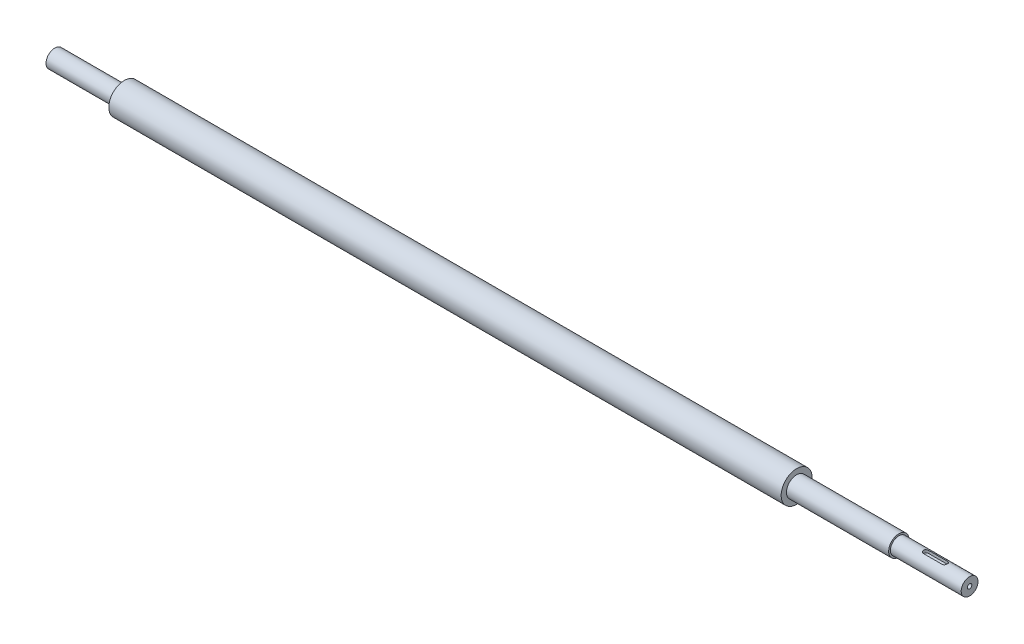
ISO-10303-21;
HEADER;
FILE_DESCRIPTION(('STEP AP214'),'2;1');
FILE_NAME('part.step','',(''),(''),'','','');
FILE_SCHEMA(('AUTOMOTIVE_DESIGN { 1 0 10303 214 1 1 1 1 }'));
ENDSEC;
DATA;
#1=APPLICATION_CONTEXT('core data for automotive mechanical design processes');
#2=APPLICATION_PROTOCOL_DEFINITION('international standard','automotive_design',2000,#1);
#3=PRODUCT_CONTEXT('',#1,'mechanical');
#4=PRODUCT('Part','Part','',(#3));
#5=PRODUCT_RELATED_PRODUCT_CATEGORY('part','',(#4));
#6=PRODUCT_DEFINITION_FORMATION('','',#4);
#7=PRODUCT_DEFINITION_CONTEXT('part definition',#1,'design');
#8=PRODUCT_DEFINITION('design','',#6,#7);
#9=PRODUCT_DEFINITION_SHAPE('','',#8);
#10=(LENGTH_UNIT() NAMED_UNIT(*) SI_UNIT(.MILLI.,.METRE.));
#11=(NAMED_UNIT(*) PLANE_ANGLE_UNIT() SI_UNIT($,.RADIAN.));
#12=(NAMED_UNIT(*) SI_UNIT($,.STERADIAN.) SOLID_ANGLE_UNIT());
#13=UNCERTAINTY_MEASURE_WITH_UNIT(LENGTH_MEASURE(1.E-05),#10,'distance_accuracy_value','');
#14=(GEOMETRIC_REPRESENTATION_CONTEXT(3) GLOBAL_UNCERTAINTY_ASSIGNED_CONTEXT((#13)) GLOBAL_UNIT_ASSIGNED_CONTEXT((#10,
#11,#12)) REPRESENTATION_CONTEXT('',''));
#15=CARTESIAN_POINT('',(0.,0.,0.));
#16=DIRECTION('',(0.,0.,1.));
#17=DIRECTION('',(1.,0.,0.));
#18=AXIS2_PLACEMENT_3D('',#15,#16,#17);
#19=CARTESIAN_POINT('',(-517.,-1.19644040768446E-13,0.));
#20=DIRECTION('',(-1.,0.,0.));
#21=DIRECTION('',(0.,-1.,0.));
#22=AXIS2_PLACEMENT_3D('',#19,#20,#21);
#23=PLANE('',#22);
#24=CARTESIAN_POINT('',(-517.,-1.19644040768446E-13,0.));
#25=DIRECTION('',(1.,0.,0.));
#26=DIRECTION('',(0.,1.,0.));
#27=AXIS2_PLACEMENT_3D('',#24,#25,#26);
#28=CIRCLE('',#27,10.);
#29=CARTESIAN_POINT('',(-517.,9.99999999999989,0.));
#30=VERTEX_POINT('',#29);
#31=EDGE_CURVE('E152',#30,#30,#28,.T.);
#32=ORIENTED_EDGE('',*,*,#31,.F.);
#33=EDGE_LOOP('',(#32));
#34=FACE_BOUND('',#33,.T.);
#35=ADVANCED_FACE('F38',(#34),#23,.T.);
#36=CARTESIAN_POINT('',(-517.,-1.19644040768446E-13,0.));
#37=DIRECTION('',(1.,0.,0.));
#38=DIRECTION('',(0.,1.,0.));
#39=AXIS2_PLACEMENT_3D('',#36,#37,#38);
#40=CYLINDRICAL_SURFACE('',#39,10.);
#41=ORIENTED_EDGE('',*,*,#31,.T.);
#42=EDGE_LOOP('',(#41));
#43=FACE_BOUND('',#42,.T.);
#44=CARTESIAN_POINT('',(-438.5,-1.19644040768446E-13,0.));
#45=DIRECTION('',(1.,0.,0.));
#46=DIRECTION('',(0.,1.,0.));
#47=AXIS2_PLACEMENT_3D('',#44,#45,#46);
#48=CIRCLE('',#47,9.99999999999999);
#49=CARTESIAN_POINT('',(-438.5,9.99999999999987,0.));
#50=VERTEX_POINT('',#49);
#51=EDGE_CURVE('E148',#50,#50,#48,.T.);
#52=ORIENTED_EDGE('',*,*,#51,.F.);
#53=EDGE_LOOP('',(#52));
#54=FACE_BOUND('',#53,.T.);
#55=ADVANCED_FACE('F210',(#43,#54),#40,.T.);
#56=CARTESIAN_POINT('',(-438.5,9.99999999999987,0.));
#57=DIRECTION('',(-1.,0.,0.));
#58=DIRECTION('',(0.,-1.,0.));
#59=AXIS2_PLACEMENT_3D('',#56,#57,#58);
#60=PLANE('',#59);
#61=ORIENTED_EDGE('',*,*,#51,.T.);
#62=EDGE_LOOP('',(#61));
#63=FACE_BOUND('',#62,.T.);
#64=CARTESIAN_POINT('',(-438.5,-1.19644040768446E-13,0.));
#65=DIRECTION('',(1.,0.,0.));
#66=DIRECTION('',(0.,1.,0.));
#67=AXIS2_PLACEMENT_3D('',#64,#65,#66);
#68=CIRCLE('',#67,17.5);
#69=CARTESIAN_POINT('',(-438.5,17.4999999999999,0.));
#70=VERTEX_POINT('',#69);
#71=EDGE_CURVE('E144',#70,#70,#68,.T.);
#72=ORIENTED_EDGE('',*,*,#71,.F.);
#73=EDGE_LOOP('',(#72));
#74=FACE_BOUND('',#73,.T.);
#75=ADVANCED_FACE('F215',(#63,#74),#60,.T.);
#76=CARTESIAN_POINT('',(-517.,-1.19644040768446E-13,0.));
#77=DIRECTION('',(1.,0.,0.));
#78=DIRECTION('',(0.,1.,0.));
#79=AXIS2_PLACEMENT_3D('',#76,#77,#78);
#80=CYLINDRICAL_SURFACE('',#79,17.5);
#81=ORIENTED_EDGE('',*,*,#71,.T.);
#82=EDGE_LOOP('',(#81));
#83=FACE_BOUND('',#82,.T.);
#84=CARTESIAN_POINT('',(321.5,-1.19644040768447E-13,0.));
#85=DIRECTION('',(1.,0.,0.));
#86=DIRECTION('',(0.,1.,0.));
#87=AXIS2_PLACEMENT_3D('',#84,#85,#86);
#88=CIRCLE('',#87,17.5);
#89=CARTESIAN_POINT('',(321.5,17.4999999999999,0.));
#90=VERTEX_POINT('',#89);
#91=EDGE_CURVE('E140',#90,#90,#88,.T.);
#92=ORIENTED_EDGE('',*,*,#91,.F.);
#93=EDGE_LOOP('',(#92));
#94=FACE_BOUND('',#93,.T.);
#95=ADVANCED_FACE('F223',(#83,#94),#80,.T.);
#96=CARTESIAN_POINT('',(321.5,17.4999999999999,0.));
#97=DIRECTION('',(1.,0.,0.));
#98=DIRECTION('',(0.,1.,0.));
#99=AXIS2_PLACEMENT_3D('',#96,#97,#98);
#100=PLANE('',#99);
#101=ORIENTED_EDGE('',*,*,#91,.T.);
#102=EDGE_LOOP('',(#101));
#103=FACE_BOUND('',#102,.T.);
#104=CARTESIAN_POINT('',(321.5,-1.19644040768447E-13,0.));
#105=DIRECTION('',(1.,0.,0.));
#106=DIRECTION('',(0.,1.,0.));
#107=AXIS2_PLACEMENT_3D('',#104,#105,#106);
#108=CIRCLE('',#107,11.5000000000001);
#109=CARTESIAN_POINT('',(321.5,11.5,0.));
#110=VERTEX_POINT('',#109);
#111=EDGE_CURVE('E136',#110,#110,#108,.T.);
#112=ORIENTED_EDGE('',*,*,#111,.F.);
#113=EDGE_LOOP('',(#112));
#114=FACE_BOUND('',#113,.T.);
#115=ADVANCED_FACE('F229',(#103,#114),#100,.T.);
#116=CARTESIAN_POINT('',(-517.,-1.19644040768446E-13,0.));
#117=DIRECTION('',(1.,0.,0.));
#118=DIRECTION('',(0.,1.,0.));
#119=AXIS2_PLACEMENT_3D('',#116,#117,#118);
#120=CYLINDRICAL_SURFACE('',#119,11.5000000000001);
#121=ORIENTED_EDGE('',*,*,#111,.T.);
#122=EDGE_LOOP('',(#121));
#123=FACE_BOUND('',#122,.T.);
#124=CARTESIAN_POINT('',(437.,-1.19644040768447E-13,0.));
#125=DIRECTION('',(1.,0.,0.));
#126=DIRECTION('',(0.,1.,0.));
#127=AXIS2_PLACEMENT_3D('',#124,#125,#126);
#128=CIRCLE('',#127,11.5000000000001);
#129=CARTESIAN_POINT('',(437.,11.5,0.));
#130=VERTEX_POINT('',#129);
#131=EDGE_CURVE('E132',#130,#130,#128,.T.);
#132=ORIENTED_EDGE('',*,*,#131,.F.);
#133=EDGE_LOOP('',(#132));
#134=FACE_BOUND('',#133,.T.);
#135=ADVANCED_FACE('F235',(#123,#134),#120,.T.);
#136=CARTESIAN_POINT('',(437.,11.5,0.));
#137=DIRECTION('',(1.,0.,0.));
#138=DIRECTION('',(0.,1.,0.));
#139=AXIS2_PLACEMENT_3D('',#136,#137,#138);
#140=PLANE('',#139);
#141=ORIENTED_EDGE('',*,*,#131,.T.);
#142=EDGE_LOOP('',(#141));
#143=FACE_BOUND('',#142,.T.);
#144=CARTESIAN_POINT('',(437.,-1.19644040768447E-13,0.));
#145=DIRECTION('',(1.,0.,0.));
#146=DIRECTION('',(0.,1.,0.));
#147=AXIS2_PLACEMENT_3D('',#144,#145,#146);
#148=CIRCLE('',#147,9.50000000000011);
#149=CARTESIAN_POINT('',(437.,9.49999999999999,0.));
#150=VERTEX_POINT('',#149);
#151=EDGE_CURVE('E128',#150,#150,#148,.T.);
#152=ORIENTED_EDGE('',*,*,#151,.F.);
#153=EDGE_LOOP('',(#152));
#154=FACE_BOUND('',#153,.T.);
#155=ADVANCED_FACE('F196',(#143,#154),#140,.T.);
#156=CARTESIAN_POINT('',(-517.,-1.19644040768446E-13,0.));
#157=DIRECTION('',(1.,0.,0.));
#158=DIRECTION('',(0.,1.,0.));
#159=AXIS2_PLACEMENT_3D('',#156,#157,#158);
#160=CYLINDRICAL_SURFACE('',#159,9.50000000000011);
#161=CARTESIAN_POINT('',(467.999999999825,9.01387818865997,-3.));
#162=CARTESIAN_POINT('',(467.917888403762,9.0138659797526,-3.00001051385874));
#163=CARTESIAN_POINT('',(467.835783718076,9.01499989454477,-2.99662905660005));
#164=CARTESIAN_POINT('',(467.672205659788,9.01946917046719,-2.98316404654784));
#165=CARTESIAN_POINT('',(467.590732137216,9.02280399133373,-2.97308213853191));
#166=CARTESIAN_POINT('',(467.429213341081,9.03157240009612,-2.94633448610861));
#167=CARTESIAN_POINT('',(467.349164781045,9.03700024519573,-2.92968675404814));
#168=CARTESIAN_POINT('',(467.190853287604,9.04977799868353,-2.88997412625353));
#169=CARTESIAN_POINT('',(467.112590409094,9.05712796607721,-2.86690903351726));
#170=CARTESIAN_POINT('',(466.8813586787,9.08173850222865,-2.78838156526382));
#171=CARTESIAN_POINT('',(466.73172583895,9.10157261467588,-2.72354999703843));
#172=CARTESIAN_POINT('',(466.445450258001,9.14584733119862,-2.57094386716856));
#173=CARTESIAN_POINT('',(466.308814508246,9.17029039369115,-2.48315705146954));
#174=CARTESIAN_POINT('',(466.047591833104,9.22198403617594,-2.2838388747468));
#175=CARTESIAN_POINT('',(465.923522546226,9.24929895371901,-2.17164444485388));
#176=CARTESIAN_POINT('',(465.695612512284,9.30311268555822,-1.92811437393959));
#177=CARTESIAN_POINT('',(465.59177526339,9.32961135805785,-1.79677542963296));
#178=CARTESIAN_POINT('',(465.404961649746,9.37954779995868,-1.51492697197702));
#179=CARTESIAN_POINT('',(465.322523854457,9.40290050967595,-1.36404405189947));
#180=CARTESIAN_POINT('',(465.184403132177,9.44315613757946,-1.04969762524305));
#181=CARTESIAN_POINT('',(465.12871272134,9.4600608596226,-0.886237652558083));
#182=CARTESIAN_POINT('',(465.047406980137,9.4850593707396,-0.556831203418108));
#183=CARTESIAN_POINT('',(465.020900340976,9.49341369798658,-0.39112486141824));
#184=CARTESIAN_POINT('',(464.99588895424,9.50129109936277,-0.0574168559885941));
#185=CARTESIAN_POINT('',(464.997378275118,9.50081604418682,0.110584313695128));
#186=CARTESIAN_POINT('',(465.027734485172,9.49126851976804,0.437828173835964));
#187=CARTESIAN_POINT('',(465.055634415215,9.48249971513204,0.597170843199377));
#188=CARTESIAN_POINT('',(465.13643093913,9.45772480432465,0.90878239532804));
#189=CARTESIAN_POINT('',(465.18932888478,9.44171830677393,1.06105089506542));
#190=CARTESIAN_POINT('',(465.319232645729,9.40386197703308,1.35640803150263));
#191=CARTESIAN_POINT('',(465.396529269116,9.38194214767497,1.49935942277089));
#192=CARTESIAN_POINT('',(465.572801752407,9.33456474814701,1.77055948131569));
#193=CARTESIAN_POINT('',(465.671782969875,9.309106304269,1.89880450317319));
#194=CARTESIAN_POINT('',(465.893553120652,9.25608223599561,2.14270544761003));
#195=CARTESIAN_POINT('',(466.017173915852,9.22847303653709,2.257596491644));
#196=CARTESIAN_POINT('',(466.282212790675,9.17518254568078,2.46526929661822));
#197=CARTESIAN_POINT('',(466.423636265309,9.14950184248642,2.55804433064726));
#198=CARTESIAN_POINT('',(466.722494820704,9.10274637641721,2.71978065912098));
#199=CARTESIAN_POINT('',(466.880103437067,9.08173131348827,2.78843918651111));
#200=CARTESIAN_POINT('',(467.205386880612,9.04739847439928,2.89791755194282));
#201=CARTESIAN_POINT('',(467.373045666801,9.0340687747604,2.93878053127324));
#202=CARTESIAN_POINT('',(467.618588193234,9.02162485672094,2.97664323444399));
#203=CARTESIAN_POINT('',(467.694629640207,9.01872707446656,2.98539986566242));
#204=CARTESIAN_POINT('',(467.847100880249,9.01485301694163,2.99707362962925));
#205=CARTESIAN_POINT('',(467.923529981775,9.01387406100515,2.99999890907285));
#206=CARTESIAN_POINT('',(467.999999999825,9.01387818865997,3.));
#207=B_SPLINE_CURVE_WITH_KNOTS('',3,(#161,#162,#163,#164,#165,#166,#167,#168,#169,#170,#171,
#172,#173,#174,#175,#176,#177,#178,#179,#180,#181,#182,#183,#184,#185,#186,#187,#188,#189,#190,
#191,#192,#193,#194,#195,#196,#197,#198,#199,#200,#201,#202,#203,#204,#205,#206),.UNSPECIFIED.,
.F.,.F.,(4,2,2,2,2,2,2,2,2,2,2,2,2,2,2,2,2,2,2,2,2,2,4),(0.,0.246245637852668,0.492430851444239,
0.737945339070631,0.983467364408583,1.47384684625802,1.9644886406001,2.47064554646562,
2.97688989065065,3.4948536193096,4.01267233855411,4.51419531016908,5.01561202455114,
5.49935290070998,5.98311993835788,6.47288577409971,6.96277275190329,7.47344235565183,
7.98426708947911,8.50129313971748,9.01751487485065,9.24710313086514,9.47637041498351),.UNSPECIFIED.);
#208=CARTESIAN_POINT('',(467.999999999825,9.01387818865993,-2.99999999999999));
#209=VERTEX_POINT('',#208);
#210=CARTESIAN_POINT('',(467.999999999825,9.01387818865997,3.));
#211=VERTEX_POINT('',#210);
#212=EDGE_CURVE('E156',#209,#211,#207,.T.);
#213=ORIENTED_EDGE('',*,*,#212,.F.);
#214=DIRECTION('',(1.,0.,0.));
#215=VECTOR('',#214,1.);
#216=CARTESIAN_POINT('',(-517.,9.01387818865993,-3.00000000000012));
#217=LINE('',#216,#215);
#218=CARTESIAN_POINT('',(488.999999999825,9.01387818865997,-2.99999999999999));
#219=VERTEX_POINT('',#218);
#220=EDGE_CURVE('E11',#219,#209,#217,.F.);
#221=ORIENTED_EDGE('',*,*,#220,.F.);
#222=CARTESIAN_POINT('',(488.999999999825,9.01387818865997,3.00000000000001));
#223=CARTESIAN_POINT('',(489.082111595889,9.0138659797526,3.00001051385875));
#224=CARTESIAN_POINT('',(489.164216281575,9.01499989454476,2.99662905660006));
#225=CARTESIAN_POINT('',(489.327794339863,9.01946917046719,2.98316404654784));
#226=CARTESIAN_POINT('',(489.409267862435,9.02280399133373,2.97308213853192));
#227=CARTESIAN_POINT('',(489.57078665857,9.03157240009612,2.94633448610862));
#228=CARTESIAN_POINT('',(489.650835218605,9.03700024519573,2.92968675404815));
#229=CARTESIAN_POINT('',(489.809146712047,9.04977799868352,2.88997412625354));
#230=CARTESIAN_POINT('',(489.887409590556,9.0571279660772,2.86690903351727));
#231=CARTESIAN_POINT('',(490.118641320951,9.08173850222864,2.78838156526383));
#232=CARTESIAN_POINT('',(490.268274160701,9.10157261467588,2.72354999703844));
#233=CARTESIAN_POINT('',(490.55454974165,9.14584733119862,2.57094386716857));
#234=CARTESIAN_POINT('',(490.691185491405,9.17029039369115,2.48315705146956));
#235=CARTESIAN_POINT('',(490.952408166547,9.22198403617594,2.2838388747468));
#236=CARTESIAN_POINT('',(491.076477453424,9.24929895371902,2.17164444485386));
#237=CARTESIAN_POINT('',(491.304387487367,9.30311268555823,1.92811437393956));
#238=CARTESIAN_POINT('',(491.408224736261,9.32961135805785,1.79677542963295));
#239=CARTESIAN_POINT('',(491.595038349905,9.37954779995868,1.51492697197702));
#240=CARTESIAN_POINT('',(491.677476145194,9.40290050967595,1.36404405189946));
#241=CARTESIAN_POINT('',(491.815596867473,9.44315613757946,1.04969762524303));
#242=CARTESIAN_POINT('',(491.87128727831,9.4600608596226,0.886237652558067));
#243=CARTESIAN_POINT('',(491.952593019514,9.4850593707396,0.556831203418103));
#244=CARTESIAN_POINT('',(491.979099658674,9.49341369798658,0.39112486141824));
#245=CARTESIAN_POINT('',(492.004111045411,9.50129109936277,0.0574168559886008));
#246=CARTESIAN_POINT('',(492.002621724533,9.50081604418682,-0.11058431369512));
#247=CARTESIAN_POINT('',(491.972265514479,9.49126851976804,-0.437828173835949));
#248=CARTESIAN_POINT('',(491.944365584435,9.48249971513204,-0.597170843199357));
#249=CARTESIAN_POINT('',(491.86356906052,9.45772480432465,-0.908782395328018));
#250=CARTESIAN_POINT('',(491.810671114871,9.44171830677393,-1.0610508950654));
#251=CARTESIAN_POINT('',(491.680767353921,9.40386197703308,-1.35640803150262));
#252=CARTESIAN_POINT('',(491.603470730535,9.38194214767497,-1.49935942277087));
#253=CARTESIAN_POINT('',(491.427198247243,9.33456474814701,-1.77055948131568));
#254=CARTESIAN_POINT('',(491.328217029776,9.309106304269,-1.89880450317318));
#255=CARTESIAN_POINT('',(491.106446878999,9.25608223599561,-2.14270544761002));
#256=CARTESIAN_POINT('',(490.982826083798,9.22847303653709,-2.25759649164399));
#257=CARTESIAN_POINT('',(490.717787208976,9.17518254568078,-2.46526929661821));
#258=CARTESIAN_POINT('',(490.576363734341,9.14950184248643,-2.55804433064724));
#259=CARTESIAN_POINT('',(490.277505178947,9.10274637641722,-2.71978065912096));
#260=CARTESIAN_POINT('',(490.119896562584,9.08173131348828,-2.78843918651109));
#261=CARTESIAN_POINT('',(489.794613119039,9.04739847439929,-2.8979175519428));
#262=CARTESIAN_POINT('',(489.62695433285,9.0340687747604,-2.93878053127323));
#263=CARTESIAN_POINT('',(489.381411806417,9.02162485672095,-2.97664323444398));
#264=CARTESIAN_POINT('',(489.305370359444,9.01872707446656,-2.9853998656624));
#265=CARTESIAN_POINT('',(489.152899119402,9.01485301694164,-2.99707362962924));
#266=CARTESIAN_POINT('',(489.076470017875,9.01387406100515,-2.99999890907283));
#267=CARTESIAN_POINT('',(488.999999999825,9.01387818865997,-2.99999999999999));
#268=B_SPLINE_CURVE_WITH_KNOTS('',3,(#222,#223,#224,#225,#226,#227,#228,#229,#230,#231,#232,
#233,#234,#235,#236,#237,#238,#239,#240,#241,#242,#243,#244,#245,#246,#247,#248,#249,#250,#251,
#252,#253,#254,#255,#256,#257,#258,#259,#260,#261,#262,#263,#264,#265,#266,#267),.UNSPECIFIED.,
.F.,.F.,(4,2,2,2,2,2,2,2,2,2,2,2,2,2,2,2,2,2,2,2,2,2,4),(0.,0.246245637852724,0.492430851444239,
0.737945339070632,0.983467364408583,1.47384684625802,1.9644886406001,2.47064554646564,
2.9768898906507,3.49485361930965,4.01267233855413,4.51419531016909,5.01561202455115,
5.49935290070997,5.98311993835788,6.47288577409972,6.9627727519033,7.47344235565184,
7.98426708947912,8.50129313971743,9.01751487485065,9.24710313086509,9.47637041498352),.UNSPECIFIED.);
#269=CARTESIAN_POINT('',(488.999999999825,9.01387818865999,3.00000000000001));
#270=VERTEX_POINT('',#269);
#271=EDGE_CURVE('E46',#270,#219,#268,.T.);
#272=ORIENTED_EDGE('',*,*,#271,.F.);
#273=DIRECTION('',(1.,0.,0.));
#274=VECTOR('',#273,1.);
#275=CARTESIAN_POINT('',(-517.,9.01387818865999,2.99999999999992));
#276=LINE('',#275,#274);
#277=EDGE_CURVE('E164',#211,#270,#276,.T.);
#278=ORIENTED_EDGE('',*,*,#277,.F.);
#279=EDGE_LOOP('',(#213,#221,#272,#278));
#280=FACE_BOUND('',#279,.T.);
#281=ORIENTED_EDGE('',*,*,#151,.T.);
#282=EDGE_LOOP('',(#281));
#283=FACE_BOUND('',#282,.T.);
#284=CARTESIAN_POINT('',(517.,-1.19644040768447E-13,0.));
#285=DIRECTION('',(1.,0.,0.));
#286=DIRECTION('',(0.,1.,0.));
#287=AXIS2_PLACEMENT_3D('',#284,#285,#286);
#288=CIRCLE('',#287,9.50000000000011);
#289=CARTESIAN_POINT('',(517.,9.49999999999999,0.));
#290=VERTEX_POINT('',#289);
#291=EDGE_CURVE('E124',#290,#290,#288,.T.);
#292=ORIENTED_EDGE('',*,*,#291,.F.);
#293=EDGE_LOOP('',(#292));
#294=FACE_BOUND('',#293,.T.);
#295=ADVANCED_FACE('F165',(#280,#283,#294),#160,.T.);
#296=CARTESIAN_POINT('',(517.,9.49999999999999,0.));
#297=DIRECTION('',(1.,0.,0.));
#298=DIRECTION('',(0.,1.,0.));
#299=AXIS2_PLACEMENT_3D('',#296,#297,#298);
#300=PLANE('',#299);
#301=CARTESIAN_POINT('',(517.,0.,0.));
#302=DIRECTION('',(1.,0.,0.));
#303=DIRECTION('',(0.,0.,-1.));
#304=AXIS2_PLACEMENT_3D('',#301,#302,#303);
#305=CIRCLE('',#304,2.49999999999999);
#306=CARTESIAN_POINT('',(517.,0.,-2.49999999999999));
#307=VERTEX_POINT('',#306);
#308=EDGE_CURVE('E121',#307,#307,#305,.T.);
#309=ORIENTED_EDGE('',*,*,#308,.F.);
#310=EDGE_LOOP('',(#309));
#311=FACE_BOUND('',#310,.T.);
#312=ORIENTED_EDGE('',*,*,#291,.T.);
#313=EDGE_LOOP('',(#312));
#314=FACE_BOUND('',#313,.T.);
#315=ADVANCED_FACE('F195',(#311,#314),#300,.T.);
#316=CARTESIAN_POINT('',(517.,0.,0.));
#317=DIRECTION('',(1.,0.,0.));
#318=DIRECTION('',(0.,0.,-1.));
#319=AXIS2_PLACEMENT_3D('',#316,#317,#318);
#320=CYLINDRICAL_SURFACE('',#319,2.49999999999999);
#321=CARTESIAN_POINT('',(499.,0.,0.));
#322=DIRECTION('',(1.,0.,0.));
#323=DIRECTION('',(0.,0.,-1.));
#324=AXIS2_PLACEMENT_3D('',#321,#322,#323);
#325=CIRCLE('',#324,2.5);
#326=CARTESIAN_POINT('',(499.,0.,-2.5));
#327=VERTEX_POINT('',#326);
#328=EDGE_CURVE('E111',#327,#327,#325,.T.);
#329=ORIENTED_EDGE('',*,*,#328,.F.);
#330=EDGE_LOOP('',(#329));
#331=FACE_BOUND('',#330,.T.);
#332=ORIENTED_EDGE('',*,*,#308,.T.);
#333=EDGE_LOOP('',(#332));
#334=FACE_BOUND('',#333,.T.);
#335=ADVANCED_FACE('F202',(#331,#334),#320,.F.);
#336=CARTESIAN_POINT('',(499.,0.,0.));
#337=DIRECTION('',(1.,0.,0.));
#338=DIRECTION('',(0.,0.,-1.));
#339=AXIS2_PLACEMENT_3D('',#336,#337,#338);
#340=CONICAL_SURFACE('',#339,2.5,1.02974425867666);
#341=CARTESIAN_POINT('',(497.497848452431,0.,0.));
#342=VERTEX_POINT('',#341);
#343=VERTEX_LOOP('',#342);
#344=FACE_BOUND('',#343,.T.);
#345=ORIENTED_EDGE('',*,*,#328,.T.);
#346=EDGE_LOOP('',(#345));
#347=FACE_BOUND('',#346,.T.);
#348=ADVANCED_FACE('F182',(#344,#347),#340,.F.);
#349=CARTESIAN_POINT('',(488.999999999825,5.99999999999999,0.));
#350=DIRECTION('',(0.,1.,0.));
#351=DIRECTION('',(-1.,0.,0.));
#352=AXIS2_PLACEMENT_3D('',#349,#350,#351);
#353=CYLINDRICAL_SURFACE('',#352,3.);
#354=DIRECTION('',(0.,1.,0.));
#355=VECTOR('',#354,1.);
#356=CARTESIAN_POINT('',(488.999999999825,5.99999999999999,3.00000000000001));
#357=LINE('',#356,#355);
#358=CARTESIAN_POINT('',(488.999999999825,5.99999999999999,3.00000000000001));
#359=VERTEX_POINT('',#358);
#360=EDGE_CURVE('E108',#359,#270,#357,.T.);
#361=ORIENTED_EDGE('',*,*,#360,.T.);
#362=ORIENTED_EDGE('',*,*,#271,.T.);
#363=DIRECTION('',(0.,1.,0.));
#364=VECTOR('',#363,1.);
#365=CARTESIAN_POINT('',(488.999999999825,5.99999999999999,-2.99999999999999));
#366=LINE('',#365,#364);
#367=CARTESIAN_POINT('',(488.999999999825,5.99999999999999,-2.99999999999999));
#368=VERTEX_POINT('',#367);
#369=EDGE_CURVE('E52',#368,#219,#366,.T.);
#370=ORIENTED_EDGE('',*,*,#369,.F.);
#371=CARTESIAN_POINT('',(488.999999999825,5.99999999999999,0.));
#372=DIRECTION('',(0.,1.,0.));
#373=DIRECTION('',(-1.,0.,0.));
#374=AXIS2_PLACEMENT_3D('',#371,#372,#373);
#375=CIRCLE('',#374,3.);
#376=EDGE_CURVE('E81',#359,#368,#375,.T.);
#377=ORIENTED_EDGE('',*,*,#376,.F.);
#378=EDGE_LOOP('',(#361,#362,#370,#377));
#379=FACE_BOUND('',#378,.T.);
#380=ADVANCED_FACE('F79',(#379),#353,.F.);
#381=CARTESIAN_POINT('',(467.999999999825,5.99999999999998,3.00000000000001));
#382=DIRECTION('',(0.,0.,1.));
#383=DIRECTION('',(1.,0.,0.));
#384=AXIS2_PLACEMENT_3D('',#381,#382,#383);
#385=PLANE('',#384);
#386=ORIENTED_EDGE('',*,*,#277,.T.);
#387=ORIENTED_EDGE('',*,*,#360,.F.);
#388=DIRECTION('',(1.,0.,0.));
#389=VECTOR('',#388,1.);
#390=CARTESIAN_POINT('',(467.999999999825,5.99999999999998,3.00000000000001));
#391=LINE('',#390,#389);
#392=CARTESIAN_POINT('',(467.999999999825,5.99999999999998,3.));
#393=VERTEX_POINT('',#392);
#394=EDGE_CURVE('E86',#393,#359,#391,.T.);
#395=ORIENTED_EDGE('',*,*,#394,.F.);
#396=DIRECTION('',(0.,1.,0.));
#397=VECTOR('',#396,1.);
#398=CARTESIAN_POINT('',(467.999999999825,5.99999999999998,3.));
#399=LINE('',#398,#397);
#400=EDGE_CURVE('E112',#393,#211,#399,.T.);
#401=ORIENTED_EDGE('',*,*,#400,.T.);
#402=EDGE_LOOP('',(#386,#387,#395,#401));
#403=FACE_BOUND('',#402,.T.);
#404=ADVANCED_FACE('F174',(#403),#385,.F.);
#405=CARTESIAN_POINT('',(467.999999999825,5.99999999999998,0.));
#406=DIRECTION('',(0.,1.,0.));
#407=DIRECTION('',(-1.,0.,0.));
#408=AXIS2_PLACEMENT_3D('',#405,#406,#407);
#409=CYLINDRICAL_SURFACE('',#408,3.);
#410=DIRECTION('',(0.,1.,0.));
#411=VECTOR('',#410,1.);
#412=CARTESIAN_POINT('',(467.999999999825,5.99999999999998,-2.99999999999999));
#413=LINE('',#412,#411);
#414=CARTESIAN_POINT('',(467.999999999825,5.99999999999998,-2.99999999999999));
#415=VERTEX_POINT('',#414);
#416=EDGE_CURVE('E85',#415,#209,#413,.T.);
#417=ORIENTED_EDGE('',*,*,#416,.T.);
#418=ORIENTED_EDGE('',*,*,#212,.T.);
#419=ORIENTED_EDGE('',*,*,#400,.F.);
#420=CARTESIAN_POINT('',(467.999999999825,5.99999999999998,0.));
#421=DIRECTION('',(0.,1.,0.));
#422=DIRECTION('',(-1.,0.,0.));
#423=AXIS2_PLACEMENT_3D('',#420,#421,#422);
#424=CIRCLE('',#423,3.);
#425=EDGE_CURVE('E96',#415,#393,#424,.T.);
#426=ORIENTED_EDGE('',*,*,#425,.F.);
#427=EDGE_LOOP('',(#417,#418,#419,#426));
#428=FACE_BOUND('',#427,.T.);
#429=ADVANCED_FACE('F169',(#428),#409,.F.);
#430=CARTESIAN_POINT('',(488.999999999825,5.99999999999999,-2.99999999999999));
#431=DIRECTION('',(0.,0.,-1.));
#432=DIRECTION('',(-1.,0.,0.));
#433=AXIS2_PLACEMENT_3D('',#430,#431,#432);
#434=PLANE('',#433);
#435=ORIENTED_EDGE('',*,*,#220,.T.);
#436=ORIENTED_EDGE('',*,*,#416,.F.);
#437=DIRECTION('',(-1.,0.,0.));
#438=VECTOR('',#437,1.);
#439=CARTESIAN_POINT('',(488.999999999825,5.99999999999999,-2.99999999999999));
#440=LINE('',#439,#438);
#441=EDGE_CURVE('E89',#368,#415,#440,.T.);
#442=ORIENTED_EDGE('',*,*,#441,.F.);
#443=ORIENTED_EDGE('',*,*,#369,.T.);
#444=EDGE_LOOP('',(#435,#436,#442,#443));
#445=FACE_BOUND('',#444,.T.);
#446=ADVANCED_FACE('F90',(#445),#434,.F.);
#447=CARTESIAN_POINT('',(488.999999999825,5.99999999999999,0.));
#448=DIRECTION('',(0.,1.,0.));
#449=DIRECTION('',(-1.,0.,0.));
#450=AXIS2_PLACEMENT_3D('',#447,#448,#449);
#451=PLANE('',#450);
#452=ORIENTED_EDGE('',*,*,#376,.T.);
#453=ORIENTED_EDGE('',*,*,#441,.T.);
#454=ORIENTED_EDGE('',*,*,#425,.T.);
#455=ORIENTED_EDGE('',*,*,#394,.T.);
#456=EDGE_LOOP('',(#452,#453,#454,#455));
#457=FACE_BOUND('',#456,.T.);
#458=ADVANCED_FACE('F98',(#457),#451,.T.);
#459=CLOSED_SHELL('',(#35,#55,#75,#95,#115,#135,#155,#295,#315,#335,#348,#380,#404,#429,#446,#458));
#460=MANIFOLD_SOLID_BREP('B2',#459);
#461=ADVANCED_BREP_SHAPE_REPRESENTATION('',(#18,#460),#14);
#462=SHAPE_DEFINITION_REPRESENTATION(#9,#461);
ENDSEC;
END-ISO-10303-21;
